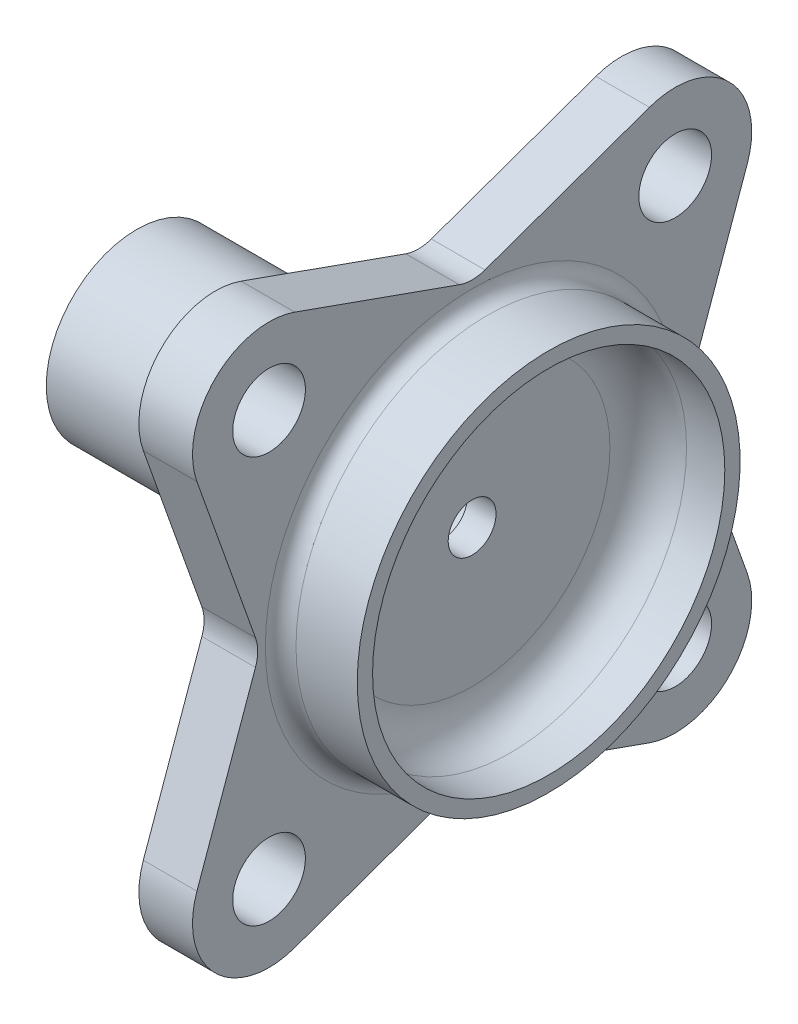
ISO-10303-21;
HEADER;
FILE_DESCRIPTION(('STEP AP214'),'2;1');
FILE_NAME('part.step','',(''),(''),'','','');
FILE_SCHEMA(('AUTOMOTIVE_DESIGN { 1 0 10303 214 1 1 1 1 }'));
ENDSEC;
DATA;
#1=APPLICATION_CONTEXT('core data for automotive mechanical design processes');
#2=APPLICATION_PROTOCOL_DEFINITION('international standard','automotive_design',2000,#1);
#3=PRODUCT_CONTEXT('',#1,'mechanical');
#4=PRODUCT('Part','Part','',(#3));
#5=PRODUCT_RELATED_PRODUCT_CATEGORY('part','',(#4));
#6=PRODUCT_DEFINITION_FORMATION('','',#4);
#7=PRODUCT_DEFINITION_CONTEXT('part definition',#1,'design');
#8=PRODUCT_DEFINITION('design','',#6,#7);
#9=PRODUCT_DEFINITION_SHAPE('','',#8);
#10=(LENGTH_UNIT() NAMED_UNIT(*) SI_UNIT(.MILLI.,.METRE.));
#11=(NAMED_UNIT(*) PLANE_ANGLE_UNIT() SI_UNIT($,.RADIAN.));
#12=(NAMED_UNIT(*) SI_UNIT($,.STERADIAN.) SOLID_ANGLE_UNIT());
#13=UNCERTAINTY_MEASURE_WITH_UNIT(LENGTH_MEASURE(1.E-05),#10,'distance_accuracy_value','');
#14=(GEOMETRIC_REPRESENTATION_CONTEXT(3) GLOBAL_UNCERTAINTY_ASSIGNED_CONTEXT((#13)) GLOBAL_UNIT_ASSIGNED_CONTEXT((#10,
#11,#12)) REPRESENTATION_CONTEXT('',''));
#15=CARTESIAN_POINT('',(0.,0.,0.));
#16=DIRECTION('',(0.,0.,1.));
#17=DIRECTION('',(1.,0.,0.));
#18=AXIS2_PLACEMENT_3D('',#15,#16,#17);
#19=CARTESIAN_POINT('',(209.598646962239,0.,0.));
#20=DIRECTION('',(1.,0.,0.));
#21=DIRECTION('',(0.,0.,-1.));
#22=AXIS2_PLACEMENT_3D('',#19,#20,#21);
#23=CYLINDRICAL_SURFACE('',#22,15.);
#24=CARTESIAN_POINT('',(39.878,0.,0.));
#25=DIRECTION('',(1.,0.,0.));
#26=DIRECTION('',(0.,1.,0.));
#27=AXIS2_PLACEMENT_3D('',#24,#25,#26);
#28=CIRCLE('',#27,15.);
#29=CARTESIAN_POINT('',(39.878,15.,0.));
#30=VERTEX_POINT('',#29);
#31=EDGE_CURVE('E203',#30,#30,#28,.T.);
#32=ORIENTED_EDGE('',*,*,#31,.F.);
#33=EDGE_LOOP('',(#32));
#34=FACE_BOUND('',#33,.T.);
#35=CARTESIAN_POINT('',(7.874,0.,0.));
#36=DIRECTION('',(-1.,0.,0.));
#37=DIRECTION('',(0.,0.,1.));
#38=AXIS2_PLACEMENT_3D('',#35,#36,#37);
#39=CIRCLE('',#38,15.);
#40=CARTESIAN_POINT('',(7.874,0.,15.));
#41=VERTEX_POINT('',#40);
#42=EDGE_CURVE('E772',#41,#41,#39,.T.);
#43=ORIENTED_EDGE('',*,*,#42,.F.);
#44=EDGE_LOOP('',(#43));
#45=FACE_BOUND('',#44,.T.);
#46=ADVANCED_FACE('F40',(#34,#45),#23,.T.);
#47=CARTESIAN_POINT('',(-5.74103503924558,0.,0.));
#48=DIRECTION('',(-1.,0.,0.));
#49=DIRECTION('',(0.,0.,1.));
#50=AXIS2_PLACEMENT_3D('',#47,#48,#49);
#51=CYLINDRICAL_SURFACE('',#50,7.9375);
#52=CARTESIAN_POINT('',(56.1975,0.,0.));
#53=DIRECTION('',(-1.,0.,0.));
#54=DIRECTION('',(0.,0.,1.));
#55=AXIS2_PLACEMENT_3D('',#52,#53,#54);
#56=CIRCLE('',#55,7.9375);
#57=CARTESIAN_POINT('',(56.1975,0.,7.9375));
#58=VERTEX_POINT('',#57);
#59=EDGE_CURVE('E264',#58,#58,#56,.T.);
#60=ORIENTED_EDGE('',*,*,#59,.F.);
#61=EDGE_LOOP('',(#60));
#62=FACE_BOUND('',#61,.T.);
#63=CARTESIAN_POINT('',(7.874,0.,0.));
#64=DIRECTION('',(-1.,0.,0.));
#65=DIRECTION('',(0.,0.,1.));
#66=AXIS2_PLACEMENT_3D('',#63,#64,#65);
#67=CIRCLE('',#66,7.9375);
#68=CARTESIAN_POINT('',(7.874,0.,7.9375));
#69=VERTEX_POINT('',#68);
#70=EDGE_CURVE('E769',#69,#69,#67,.T.);
#71=ORIENTED_EDGE('',*,*,#70,.T.);
#72=EDGE_LOOP('',(#71));
#73=FACE_BOUND('',#72,.T.);
#74=ADVANCED_FACE('F221',(#62,#73),#51,.F.);
#75=CARTESIAN_POINT('',(54.61,63.5,0.));
#76=DIRECTION('',(1.,0.,0.));
#77=DIRECTION('',(0.,0.,-1.));
#78=AXIS2_PLACEMENT_3D('',#75,#76,#77);
#79=PLANE('',#78);
#80=CARTESIAN_POINT('',(54.61,33.6759604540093,33.6759604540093));
#81=DIRECTION('',(1.,0.,0.));
#82=DIRECTION('',(0.,0.,-1.));
#83=AXIS2_PLACEMENT_3D('',#80,#81,#82);
#84=CIRCLE('',#83,7.9375);
#85=CARTESIAN_POINT('',(54.61,33.6759604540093,25.7384604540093));
#86=VERTEX_POINT('',#85);
#87=EDGE_CURVE('E49',#86,#86,#84,.F.);
#88=ORIENTED_EDGE('',*,*,#87,.F.);
#89=EDGE_LOOP('',(#88));
#90=FACE_BOUND('',#89,.T.);
#91=CARTESIAN_POINT('',(54.61,33.6759604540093,-33.6759604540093));
#92=DIRECTION('',(1.,0.,0.));
#93=DIRECTION('',(0.,0.,-1.));
#94=AXIS2_PLACEMENT_3D('',#91,#92,#93);
#95=CIRCLE('',#94,12.7);
#96=CARTESIAN_POINT('',(54.61,29.4172093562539,-45.6406183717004));
#97=VERTEX_POINT('',#96);
#98=CARTESIAN_POINT('',(54.61,45.6406183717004,-29.4172093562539));
#99=VERTEX_POINT('',#98);
#100=EDGE_CURVE('E201',#97,#99,#95,.T.);
#101=ORIENTED_EDGE('',*,*,#100,.F.);
#102=DIRECTION('',(0.,0.942099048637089,-0.335334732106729));
#103=VECTOR('',#102,1.);
#104=CARTESIAN_POINT('',(54.61,45.2486940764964,-51.2757442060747));
#105=LINE('',#104,#103);
#106=CARTESIAN_POINT('',(54.61,2.12937554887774,-35.9276710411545));
#107=VERTEX_POINT('',#106);
#108=EDGE_CURVE('E199',#107,#97,#105,.T.);
#109=ORIENTED_EDGE('',*,*,#108,.F.);
#110=CARTESIAN_POINT('',(54.61,0.,-41.91));
#111=DIRECTION('',(1.,0.,0.));
#112=DIRECTION('',(0.,0.,-1.));
#113=AXIS2_PLACEMENT_3D('',#110,#111,#112);
#114=CIRCLE('',#113,6.35);
#115=CARTESIAN_POINT('',(54.61,-2.12937554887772,-35.9276710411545));
#116=VERTEX_POINT('',#115);
#117=EDGE_CURVE('E197',#116,#107,#114,.F.);
#118=ORIENTED_EDGE('',*,*,#117,.F.);
#119=DIRECTION('',(0.,0.942099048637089,0.335334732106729));
#120=VECTOR('',#119,1.);
#121=CARTESIAN_POINT('',(54.61,67.4702343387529,-11.1540906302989));
#122=LINE('',#121,#120);
#123=CARTESIAN_POINT('',(54.61,-29.4172093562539,-45.6406183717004));
#124=VERTEX_POINT('',#123);
#125=EDGE_CURVE('E195',#124,#116,#122,.T.);
#126=ORIENTED_EDGE('',*,*,#125,.F.);
#127=CARTESIAN_POINT('',(54.61,-33.6759604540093,-33.6759604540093));
#128=DIRECTION('',(1.,0.,0.));
#129=DIRECTION('',(0.,0.,-1.));
#130=AXIS2_PLACEMENT_3D('',#127,#128,#129);
#131=CIRCLE('',#130,12.7);
#132=CARTESIAN_POINT('',(54.61,-45.6406183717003,-29.4172093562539));
#133=VERTEX_POINT('',#132);
#134=EDGE_CURVE('E193',#133,#124,#131,.T.);
#135=ORIENTED_EDGE('',*,*,#134,.F.);
#136=DIRECTION('',(0.,-0.335334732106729,-0.942099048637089));
#137=VECTOR('',#136,1.);
#138=CARTESIAN_POINT('',(54.61,-24.0743816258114,31.1715969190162));
#139=LINE('',#138,#137);
#140=CARTESIAN_POINT('',(54.61,-35.9276710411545,-2.12937554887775));
#141=VERTEX_POINT('',#140);
#142=EDGE_CURVE('E191',#141,#133,#139,.T.);
#143=ORIENTED_EDGE('',*,*,#142,.F.);
#144=CARTESIAN_POINT('',(54.61,-41.91,0.));
#145=DIRECTION('',(1.,0.,0.));
#146=DIRECTION('',(0.,0.,-1.));
#147=AXIS2_PLACEMENT_3D('',#144,#145,#146);
#148=CIRCLE('',#147,6.35000000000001);
#149=CARTESIAN_POINT('',(54.61,-35.9276710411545,2.12937554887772));
#150=VERTEX_POINT('',#149);
#151=EDGE_CURVE('E189',#150,#141,#148,.F.);
#152=ORIENTED_EDGE('',*,*,#151,.F.);
#153=DIRECTION('',(0.,0.335334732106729,-0.942099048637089));
#154=VECTOR('',#153,1.);
#155=CARTESIAN_POINT('',(54.61,-24.0743816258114,-31.1715969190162));
#156=LINE('',#155,#154);
#157=CARTESIAN_POINT('',(54.61,-45.6406183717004,29.4172093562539));
#158=VERTEX_POINT('',#157);
#159=EDGE_CURVE('E187',#158,#150,#156,.T.);
#160=ORIENTED_EDGE('',*,*,#159,.F.);
#161=CARTESIAN_POINT('',(54.61,-33.6759604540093,33.6759604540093));
#162=DIRECTION('',(1.,0.,0.));
#163=DIRECTION('',(0.,0.,-1.));
#164=AXIS2_PLACEMENT_3D('',#161,#162,#163);
#165=CIRCLE('',#164,12.7);
#166=CARTESIAN_POINT('',(54.61,-29.4172093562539,45.6406183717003));
#167=VERTEX_POINT('',#166);
#168=EDGE_CURVE('E185',#167,#158,#165,.T.);
#169=ORIENTED_EDGE('',*,*,#168,.F.);
#170=DIRECTION('',(0.,-0.942099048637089,0.335334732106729));
#171=VECTOR('',#170,1.);
#172=CARTESIAN_POINT('',(54.61,67.4702343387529,11.1540906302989));
#173=LINE('',#172,#171);
#174=CARTESIAN_POINT('',(54.61,-2.12937554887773,35.9276710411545));
#175=VERTEX_POINT('',#174);
#176=EDGE_CURVE('E183',#175,#167,#173,.T.);
#177=ORIENTED_EDGE('',*,*,#176,.F.);
#178=CARTESIAN_POINT('',(54.61,0.,41.91));
#179=DIRECTION('',(1.,0.,0.));
#180=DIRECTION('',(0.,0.,-1.));
#181=AXIS2_PLACEMENT_3D('',#178,#179,#180);
#182=CIRCLE('',#181,6.35);
#183=CARTESIAN_POINT('',(54.61,2.12937554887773,35.9276710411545));
#184=VERTEX_POINT('',#183);
#185=EDGE_CURVE('E181',#184,#175,#182,.F.);
#186=ORIENTED_EDGE('',*,*,#185,.F.);
#187=DIRECTION('',(0.,-0.942099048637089,-0.335334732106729));
#188=VECTOR('',#187,1.);
#189=CARTESIAN_POINT('',(54.61,45.2486940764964,51.2757442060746));
#190=LINE('',#189,#188);
#191=CARTESIAN_POINT('',(54.61,29.4172093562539,45.6406183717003));
#192=VERTEX_POINT('',#191);
#193=EDGE_CURVE('E179',#192,#184,#190,.T.);
#194=ORIENTED_EDGE('',*,*,#193,.F.);
#195=CARTESIAN_POINT('',(54.61,33.6759604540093,33.6759604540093));
#196=DIRECTION('',(1.,0.,0.));
#197=DIRECTION('',(0.,0.,-1.));
#198=AXIS2_PLACEMENT_3D('',#195,#196,#197);
#199=CIRCLE('',#198,12.7);
#200=CARTESIAN_POINT('',(54.61,45.6406183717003,29.4172093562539));
#201=VERTEX_POINT('',#200);
#202=EDGE_CURVE('E174',#201,#192,#199,.T.);
#203=ORIENTED_EDGE('',*,*,#202,.F.);
#204=DIRECTION('',(0.,0.335334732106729,0.942099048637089));
#205=VECTOR('',#204,1.);
#206=CARTESIAN_POINT('',(54.61,38.3554532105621,8.95005665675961));
#207=LINE('',#206,#205);
#208=CARTESIAN_POINT('',(54.61,35.9276710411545,2.12937554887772));
#209=VERTEX_POINT('',#208);
#210=EDGE_CURVE('E172',#209,#201,#207,.T.);
#211=ORIENTED_EDGE('',*,*,#210,.F.);
#212=CARTESIAN_POINT('',(54.61,41.91,0.));
#213=DIRECTION('',(1.,0.,0.));
#214=DIRECTION('',(0.,0.,-1.));
#215=AXIS2_PLACEMENT_3D('',#212,#213,#214);
#216=CIRCLE('',#215,6.35);
#217=CARTESIAN_POINT('',(54.61,35.9276710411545,-2.12937554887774));
#218=VERTEX_POINT('',#217);
#219=EDGE_CURVE('E156',#218,#209,#216,.F.);
#220=ORIENTED_EDGE('',*,*,#219,.F.);
#221=DIRECTION('',(0.,-0.335334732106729,0.942099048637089));
#222=VECTOR('',#221,1.);
#223=CARTESIAN_POINT('',(54.61,38.3554532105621,-8.95005665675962));
#224=LINE('',#223,#222);
#225=EDGE_CURVE('E151',#99,#218,#224,.T.);
#226=ORIENTED_EDGE('',*,*,#225,.F.);
#227=EDGE_LOOP('',(#101,#109,#118,#126,#135,#143,#152,#160,#169,#177,#186,#194,#203,#211,#220,#226));
#228=FACE_BOUND('',#227,.T.);
#229=CARTESIAN_POINT('',(54.61,-33.6759604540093,-33.6759604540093));
#230=DIRECTION('',(1.,0.,0.));
#231=DIRECTION('',(0.,0.,-1.));
#232=AXIS2_PLACEMENT_3D('',#229,#230,#231);
#233=CIRCLE('',#232,6.03249999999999);
#234=CARTESIAN_POINT('',(54.61,-33.6759604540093,-39.7084604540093));
#235=VERTEX_POINT('',#234);
#236=EDGE_CURVE('E380',#235,#235,#233,.T.);
#237=ORIENTED_EDGE('',*,*,#236,.T.);
#238=EDGE_LOOP('',(#237));
#239=FACE_BOUND('',#238,.T.);
#240=CARTESIAN_POINT('',(54.61,-33.6759604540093,33.6759604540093));
#241=DIRECTION('',(1.,0.,0.));
#242=DIRECTION('',(0.,0.,-1.));
#243=AXIS2_PLACEMENT_3D('',#240,#241,#242);
#244=CIRCLE('',#243,6.03249999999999);
#245=CARTESIAN_POINT('',(54.61,-33.6759604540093,27.6434604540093));
#246=VERTEX_POINT('',#245);
#247=EDGE_CURVE('E298',#246,#246,#244,.T.);
#248=ORIENTED_EDGE('',*,*,#247,.T.);
#249=EDGE_LOOP('',(#248));
#250=FACE_BOUND('',#249,.T.);
#251=CARTESIAN_POINT('',(54.61,0.,0.));
#252=DIRECTION('',(1.,0.,0.));
#253=DIRECTION('',(0.,0.,-1.));
#254=AXIS2_PLACEMENT_3D('',#251,#252,#253);
#255=CIRCLE('',#254,28.575);
#256=CARTESIAN_POINT('',(54.61,0.,-28.575));
#257=VERTEX_POINT('',#256);
#258=EDGE_CURVE('E207',#257,#257,#255,.F.);
#259=ORIENTED_EDGE('',*,*,#258,.F.);
#260=EDGE_LOOP('',(#259));
#261=FACE_BOUND('',#260,.T.);
#262=CARTESIAN_POINT('',(54.61,33.6759604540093,-33.6759604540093));
#263=DIRECTION('',(1.,0.,0.));
#264=DIRECTION('',(0.,0.,-1.));
#265=AXIS2_PLACEMENT_3D('',#262,#263,#264);
#266=CIRCLE('',#265,7.9375);
#267=CARTESIAN_POINT('',(54.61,33.6759604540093,-41.6134604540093));
#268=VERTEX_POINT('',#267);
#269=EDGE_CURVE('E12',#268,#268,#266,.F.);
#270=ORIENTED_EDGE('',*,*,#269,.F.);
#271=EDGE_LOOP('',(#270));
#272=FACE_BOUND('',#271,.T.);
#273=ADVANCED_FACE('F169',(#90,#228,#239,#250,#261,#272),#79,.F.);
#274=ORIENTED_EDGE('',*,*,#269,.T.);
#275=EDGE_LOOP('',(#274));
#276=FACE_BOUND('',#275,.T.);
#277=CARTESIAN_POINT('',(54.61,33.6759604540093,-33.6759604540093));
#278=DIRECTION('',(1.,0.,0.));
#279=DIRECTION('',(0.,0.,-1.));
#280=AXIS2_PLACEMENT_3D('',#277,#278,#279);
#281=CIRCLE('',#280,6.03249999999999);
#282=CARTESIAN_POINT('',(54.61,33.6759604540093,-39.7084604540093));
#283=VERTEX_POINT('',#282);
#284=EDGE_CURVE('E376',#283,#283,#281,.T.);
#285=ORIENTED_EDGE('',*,*,#284,.T.);
#286=EDGE_LOOP('',(#285));
#287=FACE_BOUND('',#286,.T.);
#288=ADVANCED_FACE('F220',(#276,#287),#79,.F.);
#289=ORIENTED_EDGE('',*,*,#87,.T.);
#290=EDGE_LOOP('',(#289));
#291=FACE_BOUND('',#290,.T.);
#292=CARTESIAN_POINT('',(54.61,33.6759604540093,33.6759604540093));
#293=DIRECTION('',(1.,0.,0.));
#294=DIRECTION('',(0.,0.,-1.));
#295=AXIS2_PLACEMENT_3D('',#292,#293,#294);
#296=CIRCLE('',#295,6.03249999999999);
#297=CARTESIAN_POINT('',(54.61,33.6759604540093,27.6434604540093));
#298=VERTEX_POINT('',#297);
#299=EDGE_CURVE('E289',#298,#298,#296,.T.);
#300=ORIENTED_EDGE('',*,*,#299,.T.);
#301=EDGE_LOOP('',(#300));
#302=FACE_BOUND('',#301,.T.);
#303=ADVANCED_FACE('F216',(#291,#302),#79,.F.);
#304=CARTESIAN_POINT('',(63.5,63.5,0.));
#305=DIRECTION('',(1.,0.,0.));
#306=DIRECTION('',(0.,0.,-1.));
#307=AXIS2_PLACEMENT_3D('',#304,#305,#306);
#308=PLANE('',#307);
#309=CARTESIAN_POINT('',(63.5,0.,0.));
#310=DIRECTION('',(-1.,0.,0.));
#311=DIRECTION('',(0.,0.,1.));
#312=AXIS2_PLACEMENT_3D('',#309,#310,#311);
#313=CIRCLE('',#312,34.29);
#314=CARTESIAN_POINT('',(63.5,0.,34.29));
#315=VERTEX_POINT('',#314);
#316=EDGE_CURVE('E282',#315,#315,#313,.T.);
#317=ORIENTED_EDGE('',*,*,#316,.T.);
#318=EDGE_LOOP('',(#317));
#319=FACE_BOUND('',#318,.T.);
#320=CARTESIAN_POINT('',(63.5,33.6759604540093,33.6759604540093));
#321=DIRECTION('',(1.,0.,0.));
#322=DIRECTION('',(0.,0.,-1.));
#323=AXIS2_PLACEMENT_3D('',#320,#321,#322);
#324=CIRCLE('',#323,6.0325);
#325=CARTESIAN_POINT('',(63.5,33.6759604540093,27.6434604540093));
#326=VERTEX_POINT('',#325);
#327=EDGE_CURVE('E292',#326,#326,#324,.T.);
#328=ORIENTED_EDGE('',*,*,#327,.F.);
#329=EDGE_LOOP('',(#328));
#330=FACE_BOUND('',#329,.T.);
#331=CARTESIAN_POINT('',(63.5,-33.6759604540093,33.6759604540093));
#332=DIRECTION('',(1.,0.,0.));
#333=DIRECTION('',(0.,0.,-1.));
#334=AXIS2_PLACEMENT_3D('',#331,#332,#333);
#335=CIRCLE('',#334,6.03249999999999);
#336=CARTESIAN_POINT('',(63.5,-33.6759604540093,27.6434604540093));
#337=VERTEX_POINT('',#336);
#338=EDGE_CURVE('E303',#337,#337,#335,.T.);
#339=ORIENTED_EDGE('',*,*,#338,.F.);
#340=EDGE_LOOP('',(#339));
#341=FACE_BOUND('',#340,.T.);
#342=CARTESIAN_POINT('',(63.5,-33.6759604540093,-33.6759604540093));
#343=DIRECTION('',(1.,0.,0.));
#344=DIRECTION('',(0.,0.,-1.));
#345=AXIS2_PLACEMENT_3D('',#342,#343,#344);
#346=CIRCLE('',#345,6.03249999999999);
#347=CARTESIAN_POINT('',(63.5,-33.6759604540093,-39.7084604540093));
#348=VERTEX_POINT('',#347);
#349=EDGE_CURVE('E353',#348,#348,#346,.T.);
#350=ORIENTED_EDGE('',*,*,#349,.F.);
#351=EDGE_LOOP('',(#350));
#352=FACE_BOUND('',#351,.T.);
#353=CARTESIAN_POINT('',(63.5,33.6759604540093,-33.6759604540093));
#354=DIRECTION('',(1.,0.,0.));
#355=DIRECTION('',(0.,0.,-1.));
#356=AXIS2_PLACEMENT_3D('',#353,#354,#355);
#357=CIRCLE('',#356,6.0325);
#358=CARTESIAN_POINT('',(63.5,33.6759604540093,-39.7084604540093));
#359=VERTEX_POINT('',#358);
#360=EDGE_CURVE('E357',#359,#359,#357,.T.);
#361=ORIENTED_EDGE('',*,*,#360,.F.);
#362=EDGE_LOOP('',(#361));
#363=FACE_BOUND('',#362,.T.);
#364=DIRECTION('',(0.,0.942099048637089,-0.335334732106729));
#365=VECTOR('',#364,1.);
#366=CARTESIAN_POINT('',(63.5,45.2486940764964,-51.2757442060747));
#367=LINE('',#366,#365);
#368=CARTESIAN_POINT('',(63.5,2.12937554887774,-35.9276710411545));
#369=VERTEX_POINT('',#368);
#370=CARTESIAN_POINT('',(63.5,29.4172093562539,-45.6406183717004));
#371=VERTEX_POINT('',#370);
#372=EDGE_CURVE('E361',#369,#371,#367,.T.);
#373=ORIENTED_EDGE('',*,*,#372,.T.);
#374=CARTESIAN_POINT('',(63.5,33.6759604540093,-33.6759604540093));
#375=DIRECTION('',(1.,0.,0.));
#376=DIRECTION('',(0.,0.,-1.));
#377=AXIS2_PLACEMENT_3D('',#374,#375,#376);
#378=CIRCLE('',#377,12.7);
#379=CARTESIAN_POINT('',(63.5,45.6406183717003,-29.4172093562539));
#380=VERTEX_POINT('',#379);
#381=EDGE_CURVE('E362',#371,#380,#378,.T.);
#382=ORIENTED_EDGE('',*,*,#381,.T.);
#383=DIRECTION('',(0.,-0.335334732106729,0.942099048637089));
#384=VECTOR('',#383,1.);
#385=CARTESIAN_POINT('',(63.5,38.3554532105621,-8.95005665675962));
#386=LINE('',#385,#384);
#387=CARTESIAN_POINT('',(63.5,35.9276710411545,-2.12937554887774));
#388=VERTEX_POINT('',#387);
#389=EDGE_CURVE('E779',#380,#388,#386,.T.);
#390=ORIENTED_EDGE('',*,*,#389,.T.);
#391=CARTESIAN_POINT('',(63.5,41.91,0.));
#392=DIRECTION('',(1.,0.,0.));
#393=DIRECTION('',(0.,0.,-1.));
#394=AXIS2_PLACEMENT_3D('',#391,#392,#393);
#395=CIRCLE('',#394,6.35);
#396=CARTESIAN_POINT('',(63.5,35.9276710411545,2.12937554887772));
#397=VERTEX_POINT('',#396);
#398=EDGE_CURVE('E164',#388,#397,#395,.F.);
#399=ORIENTED_EDGE('',*,*,#398,.T.);
#400=DIRECTION('',(0.,0.335334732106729,0.942099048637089));
#401=VECTOR('',#400,1.);
#402=CARTESIAN_POINT('',(63.5,38.3554532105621,8.95005665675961));
#403=LINE('',#402,#401);
#404=CARTESIAN_POINT('',(63.5,45.6406183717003,29.4172093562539));
#405=VERTEX_POINT('',#404);
#406=EDGE_CURVE('E818',#397,#405,#403,.T.);
#407=ORIENTED_EDGE('',*,*,#406,.T.);
#408=CARTESIAN_POINT('',(63.5,33.6759604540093,33.6759604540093));
#409=DIRECTION('',(1.,0.,0.));
#410=DIRECTION('',(0.,0.,-1.));
#411=AXIS2_PLACEMENT_3D('',#408,#409,#410);
#412=CIRCLE('',#411,12.7);
#413=CARTESIAN_POINT('',(63.5,29.4172093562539,45.6406183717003));
#414=VERTEX_POINT('',#413);
#415=EDGE_CURVE('E821',#405,#414,#412,.T.);
#416=ORIENTED_EDGE('',*,*,#415,.T.);
#417=DIRECTION('',(0.,-0.942099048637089,-0.335334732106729));
#418=VECTOR('',#417,1.);
#419=CARTESIAN_POINT('',(63.5,45.2486940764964,51.2757442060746));
#420=LINE('',#419,#418);
#421=CARTESIAN_POINT('',(63.5,2.12937554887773,35.9276710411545));
#422=VERTEX_POINT('',#421);
#423=EDGE_CURVE('E824',#414,#422,#420,.T.);
#424=ORIENTED_EDGE('',*,*,#423,.T.);
#425=CARTESIAN_POINT('',(63.5,0.,41.91));
#426=DIRECTION('',(1.,0.,0.));
#427=DIRECTION('',(0.,0.,-1.));
#428=AXIS2_PLACEMENT_3D('',#425,#426,#427);
#429=CIRCLE('',#428,6.35);
#430=CARTESIAN_POINT('',(63.5,-2.12937554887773,35.9276710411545));
#431=VERTEX_POINT('',#430);
#432=EDGE_CURVE('E827',#422,#431,#429,.F.);
#433=ORIENTED_EDGE('',*,*,#432,.T.);
#434=DIRECTION('',(0.,-0.942099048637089,0.335334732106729));
#435=VECTOR('',#434,1.);
#436=CARTESIAN_POINT('',(63.5,67.4702343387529,11.1540906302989));
#437=LINE('',#436,#435);
#438=CARTESIAN_POINT('',(63.5,-29.4172093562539,45.6406183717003));
#439=VERTEX_POINT('',#438);
#440=EDGE_CURVE('E830',#431,#439,#437,.T.);
#441=ORIENTED_EDGE('',*,*,#440,.T.);
#442=CARTESIAN_POINT('',(63.5,-33.6759604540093,33.6759604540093));
#443=DIRECTION('',(1.,0.,0.));
#444=DIRECTION('',(0.,0.,-1.));
#445=AXIS2_PLACEMENT_3D('',#442,#443,#444);
#446=CIRCLE('',#445,12.7);
#447=CARTESIAN_POINT('',(63.5,-45.6406183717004,29.4172093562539));
#448=VERTEX_POINT('',#447);
#449=EDGE_CURVE('E833',#439,#448,#446,.T.);
#450=ORIENTED_EDGE('',*,*,#449,.T.);
#451=DIRECTION('',(0.,0.335334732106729,-0.942099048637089));
#452=VECTOR('',#451,1.);
#453=CARTESIAN_POINT('',(63.5,-24.0743816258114,-31.1715969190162));
#454=LINE('',#453,#452);
#455=CARTESIAN_POINT('',(63.5,-35.9276710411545,2.12937554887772));
#456=VERTEX_POINT('',#455);
#457=EDGE_CURVE('E836',#448,#456,#454,.T.);
#458=ORIENTED_EDGE('',*,*,#457,.T.);
#459=CARTESIAN_POINT('',(63.5,-41.91,0.));
#460=DIRECTION('',(1.,0.,0.));
#461=DIRECTION('',(0.,0.,-1.));
#462=AXIS2_PLACEMENT_3D('',#459,#460,#461);
#463=CIRCLE('',#462,6.35000000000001);
#464=CARTESIAN_POINT('',(63.5,-35.9276710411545,-2.12937554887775));
#465=VERTEX_POINT('',#464);
#466=EDGE_CURVE('E839',#456,#465,#463,.F.);
#467=ORIENTED_EDGE('',*,*,#466,.T.);
#468=DIRECTION('',(0.,-0.335334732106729,-0.942099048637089));
#469=VECTOR('',#468,1.);
#470=CARTESIAN_POINT('',(63.5,-24.0743816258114,31.1715969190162));
#471=LINE('',#470,#469);
#472=CARTESIAN_POINT('',(63.5,-45.6406183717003,-29.4172093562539));
#473=VERTEX_POINT('',#472);
#474=EDGE_CURVE('E842',#465,#473,#471,.T.);
#475=ORIENTED_EDGE('',*,*,#474,.T.);
#476=CARTESIAN_POINT('',(63.5,-33.6759604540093,-33.6759604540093));
#477=DIRECTION('',(1.,0.,0.));
#478=DIRECTION('',(0.,0.,-1.));
#479=AXIS2_PLACEMENT_3D('',#476,#477,#478);
#480=CIRCLE('',#479,12.7);
#481=CARTESIAN_POINT('',(63.5,-29.4172093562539,-45.6406183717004));
#482=VERTEX_POINT('',#481);
#483=EDGE_CURVE('E845',#473,#482,#480,.T.);
#484=ORIENTED_EDGE('',*,*,#483,.T.);
#485=DIRECTION('',(0.,0.942099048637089,0.335334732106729));
#486=VECTOR('',#485,1.);
#487=CARTESIAN_POINT('',(63.5,67.4702343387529,-11.1540906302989));
#488=LINE('',#487,#486);
#489=CARTESIAN_POINT('',(63.5,-2.12937554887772,-35.9276710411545));
#490=VERTEX_POINT('',#489);
#491=EDGE_CURVE('E371',#482,#490,#488,.T.);
#492=ORIENTED_EDGE('',*,*,#491,.T.);
#493=CARTESIAN_POINT('',(63.5,0.,-41.91));
#494=DIRECTION('',(1.,0.,0.));
#495=DIRECTION('',(0.,0.,-1.));
#496=AXIS2_PLACEMENT_3D('',#493,#494,#495);
#497=CIRCLE('',#496,6.35);
#498=EDGE_CURVE('E364',#490,#369,#497,.F.);
#499=ORIENTED_EDGE('',*,*,#498,.T.);
#500=EDGE_LOOP('',(#373,#382,#390,#399,#407,#416,#424,#433,#441,#450,#458,#467,#475,#484,#492,#499));
#501=FACE_BOUND('',#500,.T.);
#502=ADVANCED_FACE('F235',(#319,#330,#341,#352,#363,#501),#308,.T.);
#503=ORIENTED_EDGE('',*,*,#258,.T.);
#504=EDGE_LOOP('',(#503));
#505=FACE_BOUND('',#504,.T.);
#506=CARTESIAN_POINT('',(54.61,0.,0.));
#507=DIRECTION('',(1.,0.,0.));
#508=DIRECTION('',(0.,0.,-1.));
#509=AXIS2_PLACEMENT_3D('',#506,#507,#508);
#510=CIRCLE('',#509,23.382);
#511=CARTESIAN_POINT('',(54.61,0.,-23.382));
#512=VERTEX_POINT('',#511);
#513=EDGE_CURVE('E263',#512,#512,#510,.T.);
#514=ORIENTED_EDGE('',*,*,#513,.T.);
#515=EDGE_LOOP('',(#514));
#516=FACE_BOUND('',#515,.T.);
#517=ADVANCED_FACE('F223',(#505,#516),#79,.F.);
#518=CARTESIAN_POINT('',(63.5,22.86,0.));
#519=DIRECTION('',(-1.,0.,0.));
#520=DIRECTION('',(0.,0.,1.));
#521=AXIS2_PLACEMENT_3D('',#518,#519,#520);
#522=PLANE('',#521);
#523=CARTESIAN_POINT('',(63.5,0.,0.));
#524=DIRECTION('',(1.,0.,0.));
#525=DIRECTION('',(0.,0.,-1.));
#526=AXIS2_PLACEMENT_3D('',#523,#524,#525);
#527=CIRCLE('',#526,22.86);
#528=CARTESIAN_POINT('',(63.5,0.,-22.86));
#529=VERTEX_POINT('',#528);
#530=EDGE_CURVE('E279',#529,#529,#527,.T.);
#531=ORIENTED_EDGE('',*,*,#530,.T.);
#532=EDGE_LOOP('',(#531));
#533=FACE_BOUND('',#532,.T.);
#534=CARTESIAN_POINT('',(63.5,0.,0.));
#535=DIRECTION('',(-1.,0.,0.));
#536=DIRECTION('',(0.,0.,1.));
#537=AXIS2_PLACEMENT_3D('',#534,#535,#536);
#538=CIRCLE('',#537,3.96875);
#539=CARTESIAN_POINT('',(63.5,0.,3.96875));
#540=VERTEX_POINT('',#539);
#541=EDGE_CURVE('E291',#540,#540,#538,.T.);
#542=ORIENTED_EDGE('',*,*,#541,.T.);
#543=EDGE_LOOP('',(#542));
#544=FACE_BOUND('',#543,.T.);
#545=ADVANCED_FACE('F234',(#533,#544),#522,.F.);
#546=CARTESIAN_POINT('',(-46.516862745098,0.,0.));
#547=DIRECTION('',(-1.,0.,0.));
#548=DIRECTION('',(0.,0.,1.));
#549=AXIS2_PLACEMENT_3D('',#546,#547,#548);
#550=CYLINDRICAL_SURFACE('',#549,31.75);
#551=CARTESIAN_POINT('',(76.2,0.,0.));
#552=DIRECTION('',(-1.,0.,0.));
#553=DIRECTION('',(0.,0.,1.));
#554=AXIS2_PLACEMENT_3D('',#551,#552,#553);
#555=CIRCLE('',#554,31.75);
#556=CARTESIAN_POINT('',(76.2,0.,31.75));
#557=VERTEX_POINT('',#556);
#558=EDGE_CURVE('E157',#557,#557,#555,.T.);
#559=ORIENTED_EDGE('',*,*,#558,.T.);
#560=EDGE_LOOP('',(#559));
#561=FACE_BOUND('',#560,.T.);
#562=CARTESIAN_POINT('',(66.04,0.,0.));
#563=DIRECTION('',(-1.,0.,0.));
#564=DIRECTION('',(0.,0.,1.));
#565=AXIS2_PLACEMENT_3D('',#562,#563,#564);
#566=CIRCLE('',#565,31.75);
#567=CARTESIAN_POINT('',(66.04,0.,31.75));
#568=VERTEX_POINT('',#567);
#569=EDGE_CURVE('E285',#568,#568,#566,.T.);
#570=ORIENTED_EDGE('',*,*,#569,.F.);
#571=EDGE_LOOP('',(#570));
#572=FACE_BOUND('',#571,.T.);
#573=ADVANCED_FACE('F325',(#561,#572),#550,.T.);
#574=CARTESIAN_POINT('',(66.04,0.,0.));
#575=DIRECTION('',(-1.,0.,0.));
#576=DIRECTION('',(0.,0.,1.));
#577=AXIS2_PLACEMENT_3D('',#574,#575,#576);
#578=TOROIDAL_SURFACE('',#577,34.29,2.54);
#579=ORIENTED_EDGE('',*,*,#569,.T.);
#580=EDGE_LOOP('',(#579));
#581=FACE_BOUND('',#580,.T.);
#582=ORIENTED_EDGE('',*,*,#316,.F.);
#583=EDGE_LOOP('',(#582));
#584=FACE_BOUND('',#583,.T.);
#585=ADVANCED_FACE('F331',(#581,#584),#578,.F.);
#586=CARTESIAN_POINT('',(76.2,0.,0.));
#587=DIRECTION('',(-1.,0.,0.));
#588=DIRECTION('',(0.,0.,1.));
#589=AXIS2_PLACEMENT_3D('',#586,#587,#588);
#590=PLANE('',#589);
#591=CARTESIAN_POINT('',(76.2,0.,0.));
#592=DIRECTION('',(1.,0.,0.));
#593=DIRECTION('',(0.,0.,-1.));
#594=AXIS2_PLACEMENT_3D('',#591,#592,#593);
#595=CIRCLE('',#594,29.21);
#596=CARTESIAN_POINT('',(76.2,0.,-29.21));
#597=VERTEX_POINT('',#596);
#598=EDGE_CURVE('E267',#597,#597,#595,.T.);
#599=ORIENTED_EDGE('',*,*,#598,.F.);
#600=EDGE_LOOP('',(#599));
#601=FACE_BOUND('',#600,.T.);
#602=ORIENTED_EDGE('',*,*,#558,.F.);
#603=EDGE_LOOP('',(#602));
#604=FACE_BOUND('',#603,.T.);
#605=ADVANCED_FACE('F42',(#601,#604),#590,.F.);
#606=CARTESIAN_POINT('',(69.85,0.,0.));
#607=DIRECTION('',(1.,0.,0.));
#608=DIRECTION('',(0.,0.,-1.));
#609=AXIS2_PLACEMENT_3D('',#606,#607,#608);
#610=TOROIDAL_SURFACE('',#609,22.86,6.35);
#611=ORIENTED_EDGE('',*,*,#530,.F.);
#612=EDGE_LOOP('',(#611));
#613=FACE_BOUND('',#612,.T.);
#614=CARTESIAN_POINT('',(69.85,0.,0.));
#615=DIRECTION('',(1.,0.,0.));
#616=DIRECTION('',(0.,0.,-1.));
#617=AXIS2_PLACEMENT_3D('',#614,#615,#616);
#618=CIRCLE('',#617,29.21);
#619=CARTESIAN_POINT('',(69.85,0.,-29.21));
#620=VERTEX_POINT('',#619);
#621=EDGE_CURVE('E276',#620,#620,#618,.T.);
#622=ORIENTED_EDGE('',*,*,#621,.T.);
#623=EDGE_LOOP('',(#622));
#624=FACE_BOUND('',#623,.T.);
#625=ADVANCED_FACE('F336',(#613,#624),#610,.F.);
#626=CARTESIAN_POINT('',(216.384356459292,0.,0.));
#627=DIRECTION('',(1.,0.,0.));
#628=DIRECTION('',(0.,0.,-1.));
#629=AXIS2_PLACEMENT_3D('',#626,#627,#628);
#630=CYLINDRICAL_SURFACE('',#629,29.21);
#631=ORIENTED_EDGE('',*,*,#621,.F.);
#632=EDGE_LOOP('',(#631));
#633=FACE_BOUND('',#632,.T.);
#634=ORIENTED_EDGE('',*,*,#598,.T.);
#635=EDGE_LOOP('',(#634));
#636=FACE_BOUND('',#635,.T.);
#637=ADVANCED_FACE('F256',(#633,#636),#630,.F.);
#638=CARTESIAN_POINT('',(46.228,0.,0.));
#639=DIRECTION('',(1.,0.,0.));
#640=DIRECTION('',(0.,0.,-1.));
#641=AXIS2_PLACEMENT_3D('',#638,#639,#640);
#642=TOROIDAL_SURFACE('',#641,23.382,8.382);
#643=ORIENTED_EDGE('',*,*,#513,.F.);
#644=EDGE_LOOP('',(#643));
#645=FACE_BOUND('',#644,.T.);
#646=CARTESIAN_POINT('',(46.228,0.,0.));
#647=DIRECTION('',(1.,0.,0.));
#648=DIRECTION('',(0.,0.,-1.));
#649=AXIS2_PLACEMENT_3D('',#646,#647,#648);
#650=CIRCLE('',#649,15.);
#651=CARTESIAN_POINT('',(46.228,0.,-15.));
#652=VERTEX_POINT('',#651);
#653=EDGE_CURVE('E261',#652,#652,#650,.T.);
#654=ORIENTED_EDGE('',*,*,#653,.T.);
#655=EDGE_LOOP('',(#654));
#656=FACE_BOUND('',#655,.T.);
#657=ADVANCED_FACE('F247',(#645,#656),#642,.F.);
#658=ORIENTED_EDGE('',*,*,#31,.T.);
#659=EDGE_LOOP('',(#658));
#660=FACE_BOUND('',#659,.T.);
#661=ORIENTED_EDGE('',*,*,#653,.F.);
#662=EDGE_LOOP('',(#661));
#663=FACE_BOUND('',#662,.T.);
#664=ADVANCED_FACE('F240',(#660,#663),#23,.T.);
#665=CARTESIAN_POINT('',(56.1975,0.,0.));
#666=DIRECTION('',(-1.,0.,0.));
#667=DIRECTION('',(0.,0.,1.));
#668=AXIS2_PLACEMENT_3D('',#665,#666,#667);
#669=TOROIDAL_SURFACE('',#668,5.3975,2.54);
#670=ORIENTED_EDGE('',*,*,#59,.T.);
#671=EDGE_LOOP('',(#670));
#672=FACE_BOUND('',#671,.T.);
#673=CARTESIAN_POINT('',(58.7375,0.,0.));
#674=DIRECTION('',(-1.,0.,0.));
#675=DIRECTION('',(0.,0.,1.));
#676=AXIS2_PLACEMENT_3D('',#673,#674,#675);
#677=CIRCLE('',#676,5.3975);
#678=CARTESIAN_POINT('',(58.7375,0.,5.3975));
#679=VERTEX_POINT('',#678);
#680=EDGE_CURVE('E270',#679,#679,#677,.T.);
#681=ORIENTED_EDGE('',*,*,#680,.F.);
#682=EDGE_LOOP('',(#681));
#683=FACE_BOUND('',#682,.T.);
#684=ADVANCED_FACE('F246',(#672,#683),#669,.F.);
#685=CARTESIAN_POINT('',(58.7375,5.3975,0.));
#686=DIRECTION('',(-1.,0.,0.));
#687=DIRECTION('',(0.,0.,1.));
#688=AXIS2_PLACEMENT_3D('',#685,#686,#687);
#689=PLANE('',#688);
#690=ORIENTED_EDGE('',*,*,#680,.T.);
#691=EDGE_LOOP('',(#690));
#692=FACE_BOUND('',#691,.T.);
#693=CARTESIAN_POINT('',(58.7375,0.,0.));
#694=DIRECTION('',(-1.,0.,0.));
#695=DIRECTION('',(0.,0.,1.));
#696=AXIS2_PLACEMENT_3D('',#693,#694,#695);
#697=CIRCLE('',#696,3.96875);
#698=CARTESIAN_POINT('',(58.7375,0.,3.96875));
#699=VERTEX_POINT('',#698);
#700=EDGE_CURVE('E295',#699,#699,#697,.T.);
#701=ORIENTED_EDGE('',*,*,#700,.F.);
#702=EDGE_LOOP('',(#701));
#703=FACE_BOUND('',#702,.T.);
#704=ADVANCED_FACE('F253',(#692,#703),#689,.T.);
#705=CARTESIAN_POINT('',(-5.74103503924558,0.,0.));
#706=DIRECTION('',(-1.,0.,0.));
#707=DIRECTION('',(0.,0.,1.));
#708=AXIS2_PLACEMENT_3D('',#705,#706,#707);
#709=CYLINDRICAL_SURFACE('',#708,3.96875);
#710=ORIENTED_EDGE('',*,*,#700,.T.);
#711=EDGE_LOOP('',(#710));
#712=FACE_BOUND('',#711,.T.);
#713=ORIENTED_EDGE('',*,*,#541,.F.);
#714=EDGE_LOOP('',(#713));
#715=FACE_BOUND('',#714,.T.);
#716=ADVANCED_FACE('F314',(#712,#715),#709,.F.);
#717=CARTESIAN_POINT('',(63.5,33.6759604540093,33.6759604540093));
#718=DIRECTION('',(1.,0.,0.));
#719=DIRECTION('',(0.,0.,-1.));
#720=AXIS2_PLACEMENT_3D('',#717,#718,#719);
#721=CYLINDRICAL_SURFACE('',#720,6.03249999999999);
#722=ORIENTED_EDGE('',*,*,#327,.T.);
#723=EDGE_LOOP('',(#722));
#724=FACE_BOUND('',#723,.T.);
#725=ORIENTED_EDGE('',*,*,#299,.F.);
#726=EDGE_LOOP('',(#725));
#727=FACE_BOUND('',#726,.T.);
#728=ADVANCED_FACE('F320',(#724,#727),#721,.F.);
#729=CARTESIAN_POINT('',(63.5,-33.6759604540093,33.6759604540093));
#730=DIRECTION('',(1.,0.,0.));
#731=DIRECTION('',(0.,0.,-1.));
#732=AXIS2_PLACEMENT_3D('',#729,#730,#731);
#733=CYLINDRICAL_SURFACE('',#732,6.03249999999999);
#734=ORIENTED_EDGE('',*,*,#338,.T.);
#735=EDGE_LOOP('',(#734));
#736=FACE_BOUND('',#735,.T.);
#737=ORIENTED_EDGE('',*,*,#247,.F.);
#738=EDGE_LOOP('',(#737));
#739=FACE_BOUND('',#738,.T.);
#740=ADVANCED_FACE('F383',(#736,#739),#733,.F.);
#741=CARTESIAN_POINT('',(63.5,-33.6759604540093,-33.6759604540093));
#742=DIRECTION('',(1.,0.,0.));
#743=DIRECTION('',(0.,0.,-1.));
#744=AXIS2_PLACEMENT_3D('',#741,#742,#743);
#745=CYLINDRICAL_SURFACE('',#744,6.03249999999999);
#746=ORIENTED_EDGE('',*,*,#349,.T.);
#747=EDGE_LOOP('',(#746));
#748=FACE_BOUND('',#747,.T.);
#749=ORIENTED_EDGE('',*,*,#236,.F.);
#750=EDGE_LOOP('',(#749));
#751=FACE_BOUND('',#750,.T.);
#752=ADVANCED_FACE('F386',(#748,#751),#745,.F.);
#753=CARTESIAN_POINT('',(63.5,33.6759604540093,-33.6759604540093));
#754=DIRECTION('',(1.,0.,0.));
#755=DIRECTION('',(0.,0.,-1.));
#756=AXIS2_PLACEMENT_3D('',#753,#754,#755);
#757=CYLINDRICAL_SURFACE('',#756,6.03249999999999);
#758=ORIENTED_EDGE('',*,*,#360,.T.);
#759=EDGE_LOOP('',(#758));
#760=FACE_BOUND('',#759,.T.);
#761=ORIENTED_EDGE('',*,*,#284,.F.);
#762=EDGE_LOOP('',(#761));
#763=FACE_BOUND('',#762,.T.);
#764=ADVANCED_FACE('F397',(#760,#763),#757,.F.);
#765=CARTESIAN_POINT('',(0.,33.6759604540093,-33.6759604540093));
#766=DIRECTION('',(1.,0.,0.));
#767=DIRECTION('',(0.,0.,-1.));
#768=AXIS2_PLACEMENT_3D('',#765,#766,#767);
#769=CYLINDRICAL_SURFACE('',#768,12.7);
#770=DIRECTION('',(1.,0.,0.));
#771=VECTOR('',#770,1.);
#772=CARTESIAN_POINT('',(0.,29.4172093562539,-45.6406183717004));
#773=LINE('',#772,#771);
#774=EDGE_CURVE('E777',#97,#371,#773,.T.);
#775=ORIENTED_EDGE('',*,*,#774,.F.);
#776=ORIENTED_EDGE('',*,*,#100,.T.);
#777=DIRECTION('',(1.,0.,0.));
#778=VECTOR('',#777,1.);
#779=CARTESIAN_POINT('',(0.,45.6406183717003,-29.4172093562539));
#780=LINE('',#779,#778);
#781=EDGE_CURVE('E61',#99,#380,#780,.T.);
#782=ORIENTED_EDGE('',*,*,#781,.T.);
#783=ORIENTED_EDGE('',*,*,#381,.F.);
#784=EDGE_LOOP('',(#775,#776,#782,#783));
#785=FACE_BOUND('',#784,.T.);
#786=ADVANCED_FACE('F399',(#785),#769,.T.);
#787=CARTESIAN_POINT('',(0.,29.4172093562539,-45.6406183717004));
#788=DIRECTION('',(0.,-0.335334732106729,-0.942099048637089));
#789=DIRECTION('',(0.,0.942099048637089,-0.335334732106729));
#790=AXIS2_PLACEMENT_3D('',#787,#788,#789);
#791=PLANE('',#790);
#792=DIRECTION('',(1.,0.,0.));
#793=VECTOR('',#792,1.);
#794=CARTESIAN_POINT('',(0.,2.12937554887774,-35.9276710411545));
#795=LINE('',#794,#793);
#796=EDGE_CURVE('E780',#107,#369,#795,.T.);
#797=ORIENTED_EDGE('',*,*,#796,.F.);
#798=ORIENTED_EDGE('',*,*,#108,.T.);
#799=ORIENTED_EDGE('',*,*,#774,.T.);
#800=ORIENTED_EDGE('',*,*,#372,.F.);
#801=EDGE_LOOP('',(#797,#798,#799,#800));
#802=FACE_BOUND('',#801,.T.);
#803=ADVANCED_FACE('F406',(#802),#791,.T.);
#804=CARTESIAN_POINT('',(0.,0.,-41.91));
#805=DIRECTION('',(1.,0.,0.));
#806=DIRECTION('',(0.,0.,-1.));
#807=AXIS2_PLACEMENT_3D('',#804,#805,#806);
#808=CYLINDRICAL_SURFACE('',#807,6.35);
#809=DIRECTION('',(1.,0.,0.));
#810=VECTOR('',#809,1.);
#811=CARTESIAN_POINT('',(0.,-2.12937554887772,-35.9276710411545));
#812=LINE('',#811,#810);
#813=EDGE_CURVE('E782',#116,#490,#812,.T.);
#814=ORIENTED_EDGE('',*,*,#813,.F.);
#815=ORIENTED_EDGE('',*,*,#117,.T.);
#816=ORIENTED_EDGE('',*,*,#796,.T.);
#817=ORIENTED_EDGE('',*,*,#498,.F.);
#818=EDGE_LOOP('',(#814,#815,#816,#817));
#819=FACE_BOUND('',#818,.T.);
#820=ADVANCED_FACE('F630',(#819),#808,.F.);
#821=CARTESIAN_POINT('',(0.,-2.12937554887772,-35.9276710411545));
#822=DIRECTION('',(0.,0.335334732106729,-0.942099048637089));
#823=DIRECTION('',(0.,0.942099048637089,0.335334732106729));
#824=AXIS2_PLACEMENT_3D('',#821,#822,#823);
#825=PLANE('',#824);
#826=DIRECTION('',(1.,0.,0.));
#827=VECTOR('',#826,1.);
#828=CARTESIAN_POINT('',(0.,-29.4172093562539,-45.6406183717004));
#829=LINE('',#828,#827);
#830=EDGE_CURVE('E785',#124,#482,#829,.T.);
#831=ORIENTED_EDGE('',*,*,#830,.F.);
#832=ORIENTED_EDGE('',*,*,#125,.T.);
#833=ORIENTED_EDGE('',*,*,#813,.T.);
#834=ORIENTED_EDGE('',*,*,#491,.F.);
#835=EDGE_LOOP('',(#831,#832,#833,#834));
#836=FACE_BOUND('',#835,.T.);
#837=ADVANCED_FACE('F450',(#836),#825,.T.);
#838=CARTESIAN_POINT('',(0.,-33.6759604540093,-33.6759604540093));
#839=DIRECTION('',(1.,0.,0.));
#840=DIRECTION('',(0.,0.,-1.));
#841=AXIS2_PLACEMENT_3D('',#838,#839,#840);
#842=CYLINDRICAL_SURFACE('',#841,12.7);
#843=DIRECTION('',(1.,0.,0.));
#844=VECTOR('',#843,1.);
#845=CARTESIAN_POINT('',(0.,-45.6406183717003,-29.4172093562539));
#846=LINE('',#845,#844);
#847=EDGE_CURVE('E788',#133,#473,#846,.T.);
#848=ORIENTED_EDGE('',*,*,#847,.F.);
#849=ORIENTED_EDGE('',*,*,#134,.T.);
#850=ORIENTED_EDGE('',*,*,#830,.T.);
#851=ORIENTED_EDGE('',*,*,#483,.F.);
#852=EDGE_LOOP('',(#848,#849,#850,#851));
#853=FACE_BOUND('',#852,.T.);
#854=ADVANCED_FACE('F444',(#853),#842,.T.);
#855=CARTESIAN_POINT('',(0.,-45.6406183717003,-29.4172093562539));
#856=DIRECTION('',(0.,-0.942099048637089,0.335334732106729));
#857=DIRECTION('',(0.,-0.335334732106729,-0.942099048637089));
#858=AXIS2_PLACEMENT_3D('',#855,#856,#857);
#859=PLANE('',#858);
#860=DIRECTION('',(1.,0.,0.));
#861=VECTOR('',#860,1.);
#862=CARTESIAN_POINT('',(0.,-35.9276710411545,-2.12937554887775));
#863=LINE('',#862,#861);
#864=EDGE_CURVE('E791',#141,#465,#863,.T.);
#865=ORIENTED_EDGE('',*,*,#864,.F.);
#866=ORIENTED_EDGE('',*,*,#142,.T.);
#867=ORIENTED_EDGE('',*,*,#847,.T.);
#868=ORIENTED_EDGE('',*,*,#474,.F.);
#869=EDGE_LOOP('',(#865,#866,#867,#868));
#870=FACE_BOUND('',#869,.T.);
#871=ADVANCED_FACE('F449',(#870),#859,.T.);
#872=CARTESIAN_POINT('',(0.,-41.91,0.));
#873=DIRECTION('',(1.,0.,0.));
#874=DIRECTION('',(0.,0.,-1.));
#875=AXIS2_PLACEMENT_3D('',#872,#873,#874);
#876=CYLINDRICAL_SURFACE('',#875,6.35000000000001);
#877=DIRECTION('',(1.,0.,0.));
#878=VECTOR('',#877,1.);
#879=CARTESIAN_POINT('',(0.,-35.9276710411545,2.12937554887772));
#880=LINE('',#879,#878);
#881=EDGE_CURVE('E794',#150,#456,#880,.T.);
#882=ORIENTED_EDGE('',*,*,#881,.F.);
#883=ORIENTED_EDGE('',*,*,#151,.T.);
#884=ORIENTED_EDGE('',*,*,#864,.T.);
#885=ORIENTED_EDGE('',*,*,#466,.F.);
#886=EDGE_LOOP('',(#882,#883,#884,#885));
#887=FACE_BOUND('',#886,.T.);
#888=ADVANCED_FACE('F607',(#887),#876,.F.);
#889=CARTESIAN_POINT('',(0.,-35.9276710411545,2.12937554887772));
#890=DIRECTION('',(0.,-0.942099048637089,-0.335334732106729));
#891=DIRECTION('',(0.,0.335334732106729,-0.942099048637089));
#892=AXIS2_PLACEMENT_3D('',#889,#890,#891);
#893=PLANE('',#892);
#894=DIRECTION('',(1.,0.,0.));
#895=VECTOR('',#894,1.);
#896=CARTESIAN_POINT('',(0.,-45.6406183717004,29.4172093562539));
#897=LINE('',#896,#895);
#898=EDGE_CURVE('E797',#158,#448,#897,.T.);
#899=ORIENTED_EDGE('',*,*,#898,.F.);
#900=ORIENTED_EDGE('',*,*,#159,.T.);
#901=ORIENTED_EDGE('',*,*,#881,.T.);
#902=ORIENTED_EDGE('',*,*,#457,.F.);
#903=EDGE_LOOP('',(#899,#900,#901,#902));
#904=FACE_BOUND('',#903,.T.);
#905=ADVANCED_FACE('F466',(#904),#893,.T.);
#906=CARTESIAN_POINT('',(0.,-33.6759604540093,33.6759604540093));
#907=DIRECTION('',(1.,0.,0.));
#908=DIRECTION('',(0.,0.,-1.));
#909=AXIS2_PLACEMENT_3D('',#906,#907,#908);
#910=CYLINDRICAL_SURFACE('',#909,12.7);
#911=DIRECTION('',(1.,0.,0.));
#912=VECTOR('',#911,1.);
#913=CARTESIAN_POINT('',(0.,-29.4172093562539,45.6406183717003));
#914=LINE('',#913,#912);
#915=EDGE_CURVE('E800',#167,#439,#914,.T.);
#916=ORIENTED_EDGE('',*,*,#915,.F.);
#917=ORIENTED_EDGE('',*,*,#168,.T.);
#918=ORIENTED_EDGE('',*,*,#898,.T.);
#919=ORIENTED_EDGE('',*,*,#449,.F.);
#920=EDGE_LOOP('',(#916,#917,#918,#919));
#921=FACE_BOUND('',#920,.T.);
#922=ADVANCED_FACE('F460',(#921),#910,.T.);
#923=CARTESIAN_POINT('',(0.,-29.4172093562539,45.6406183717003));
#924=DIRECTION('',(0.,0.335334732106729,0.942099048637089));
#925=DIRECTION('',(0.,-0.942099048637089,0.335334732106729));
#926=AXIS2_PLACEMENT_3D('',#923,#924,#925);
#927=PLANE('',#926);
#928=DIRECTION('',(1.,0.,0.));
#929=VECTOR('',#928,1.);
#930=CARTESIAN_POINT('',(0.,-2.12937554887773,35.9276710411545));
#931=LINE('',#930,#929);
#932=EDGE_CURVE('E803',#175,#431,#931,.T.);
#933=ORIENTED_EDGE('',*,*,#932,.F.);
#934=ORIENTED_EDGE('',*,*,#176,.T.);
#935=ORIENTED_EDGE('',*,*,#915,.T.);
#936=ORIENTED_EDGE('',*,*,#440,.F.);
#937=EDGE_LOOP('',(#933,#934,#935,#936));
#938=FACE_BOUND('',#937,.T.);
#939=ADVANCED_FACE('F465',(#938),#927,.T.);
#940=CARTESIAN_POINT('',(0.,0.,41.91));
#941=DIRECTION('',(1.,0.,0.));
#942=DIRECTION('',(0.,0.,-1.));
#943=AXIS2_PLACEMENT_3D('',#940,#941,#942);
#944=CYLINDRICAL_SURFACE('',#943,6.35);
#945=DIRECTION('',(1.,0.,0.));
#946=VECTOR('',#945,1.);
#947=CARTESIAN_POINT('',(0.,2.12937554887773,35.9276710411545));
#948=LINE('',#947,#946);
#949=EDGE_CURVE('E806',#184,#422,#948,.T.);
#950=ORIENTED_EDGE('',*,*,#949,.F.);
#951=ORIENTED_EDGE('',*,*,#185,.T.);
#952=ORIENTED_EDGE('',*,*,#932,.T.);
#953=ORIENTED_EDGE('',*,*,#432,.F.);
#954=EDGE_LOOP('',(#950,#951,#952,#953));
#955=FACE_BOUND('',#954,.T.);
#956=ADVANCED_FACE('F584',(#955),#944,.F.);
#957=CARTESIAN_POINT('',(0.,2.12937554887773,35.9276710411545));
#958=DIRECTION('',(0.,-0.335334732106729,0.942099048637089));
#959=DIRECTION('',(0.,-0.942099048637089,-0.335334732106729));
#960=AXIS2_PLACEMENT_3D('',#957,#958,#959);
#961=PLANE('',#960);
#962=DIRECTION('',(1.,0.,0.));
#963=VECTOR('',#962,1.);
#964=CARTESIAN_POINT('',(0.,29.4172093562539,45.6406183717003));
#965=LINE('',#964,#963);
#966=EDGE_CURVE('E809',#192,#414,#965,.T.);
#967=ORIENTED_EDGE('',*,*,#966,.F.);
#968=ORIENTED_EDGE('',*,*,#193,.T.);
#969=ORIENTED_EDGE('',*,*,#949,.T.);
#970=ORIENTED_EDGE('',*,*,#423,.F.);
#971=EDGE_LOOP('',(#967,#968,#969,#970));
#972=FACE_BOUND('',#971,.T.);
#973=ADVANCED_FACE('F482',(#972),#961,.T.);
#974=CARTESIAN_POINT('',(0.,33.6759604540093,33.6759604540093));
#975=DIRECTION('',(1.,0.,0.));
#976=DIRECTION('',(0.,0.,-1.));
#977=AXIS2_PLACEMENT_3D('',#974,#975,#976);
#978=CYLINDRICAL_SURFACE('',#977,12.7);
#979=DIRECTION('',(1.,0.,0.));
#980=VECTOR('',#979,1.);
#981=CARTESIAN_POINT('',(0.,45.6406183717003,29.4172093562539));
#982=LINE('',#981,#980);
#983=EDGE_CURVE('E812',#201,#405,#982,.T.);
#984=ORIENTED_EDGE('',*,*,#983,.F.);
#985=ORIENTED_EDGE('',*,*,#202,.T.);
#986=ORIENTED_EDGE('',*,*,#966,.T.);
#987=ORIENTED_EDGE('',*,*,#415,.F.);
#988=EDGE_LOOP('',(#984,#985,#986,#987));
#989=FACE_BOUND('',#988,.T.);
#990=ADVANCED_FACE('F476',(#989),#978,.T.);
#991=CARTESIAN_POINT('',(0.,45.6406183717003,29.4172093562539));
#992=DIRECTION('',(0.,0.942099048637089,-0.335334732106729));
#993=DIRECTION('',(0.,0.335334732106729,0.942099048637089));
#994=AXIS2_PLACEMENT_3D('',#991,#992,#993);
#995=PLANE('',#994);
#996=DIRECTION('',(1.,0.,0.));
#997=VECTOR('',#996,1.);
#998=CARTESIAN_POINT('',(0.,35.9276710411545,2.12937554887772));
#999=LINE('',#998,#997);
#1000=EDGE_CURVE('E166',#209,#397,#999,.T.);
#1001=ORIENTED_EDGE('',*,*,#1000,.F.);
#1002=ORIENTED_EDGE('',*,*,#210,.T.);
#1003=ORIENTED_EDGE('',*,*,#983,.T.);
#1004=ORIENTED_EDGE('',*,*,#406,.F.);
#1005=EDGE_LOOP('',(#1001,#1002,#1003,#1004));
#1006=FACE_BOUND('',#1005,.T.);
#1007=ADVANCED_FACE('F481',(#1006),#995,.T.);
#1008=CARTESIAN_POINT('',(0.,41.91,0.));
#1009=DIRECTION('',(1.,0.,0.));
#1010=DIRECTION('',(0.,0.,-1.));
#1011=AXIS2_PLACEMENT_3D('',#1008,#1009,#1010);
#1012=CYLINDRICAL_SURFACE('',#1011,6.35);
#1013=DIRECTION('',(1.,0.,0.));
#1014=VECTOR('',#1013,1.);
#1015=CARTESIAN_POINT('',(0.,35.9276710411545,-2.12937554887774));
#1016=LINE('',#1015,#1014);
#1017=EDGE_CURVE('E56',#218,#388,#1016,.T.);
#1018=ORIENTED_EDGE('',*,*,#1017,.F.);
#1019=ORIENTED_EDGE('',*,*,#219,.T.);
#1020=ORIENTED_EDGE('',*,*,#1000,.T.);
#1021=ORIENTED_EDGE('',*,*,#398,.F.);
#1022=EDGE_LOOP('',(#1018,#1019,#1020,#1021));
#1023=FACE_BOUND('',#1022,.T.);
#1024=ADVANCED_FACE('F160',(#1023),#1012,.F.);
#1025=CARTESIAN_POINT('',(0.,35.9276710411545,-2.12937554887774));
#1026=DIRECTION('',(0.,0.942099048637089,0.335334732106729));
#1027=DIRECTION('',(0.,-0.335334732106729,0.942099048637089));
#1028=AXIS2_PLACEMENT_3D('',#1025,#1026,#1027);
#1029=PLANE('',#1028);
#1030=ORIENTED_EDGE('',*,*,#781,.F.);
#1031=ORIENTED_EDGE('',*,*,#225,.T.);
#1032=ORIENTED_EDGE('',*,*,#1017,.T.);
#1033=ORIENTED_EDGE('',*,*,#389,.F.);
#1034=EDGE_LOOP('',(#1030,#1031,#1032,#1033));
#1035=FACE_BOUND('',#1034,.T.);
#1036=ADVANCED_FACE('F152',(#1035),#1029,.T.);
#1037=CARTESIAN_POINT('',(7.874,0.,0.));
#1038=DIRECTION('',(-1.,0.,0.));
#1039=DIRECTION('',(0.,0.,1.));
#1040=AXIS2_PLACEMENT_3D('',#1037,#1038,#1039);
#1041=PLANE('',#1040);
#1042=ORIENTED_EDGE('',*,*,#70,.F.);
#1043=EDGE_LOOP('',(#1042));
#1044=FACE_BOUND('',#1043,.T.);
#1045=ORIENTED_EDGE('',*,*,#42,.T.);
#1046=EDGE_LOOP('',(#1045));
#1047=FACE_BOUND('',#1046,.T.);
#1048=ADVANCED_FACE('F559',(#1044,#1047),#1041,.T.);
#1049=CLOSED_SHELL('',(#46,#74,#273,#288,#303,#502,#517,#545,#573,#585,#605,#625,#637,#657,#664,
#684,#704,#716,#728,#740,#752,#764,#786,#803,#820,#837,#854,#871,#888,#905,#922,#939,#956,#973,
#990,#1007,#1024,#1036,#1048));
#1050=MANIFOLD_SOLID_BREP('B2',#1049);
#1051=ADVANCED_BREP_SHAPE_REPRESENTATION('',(#18,#1050),#14);
#1052=SHAPE_DEFINITION_REPRESENTATION(#9,#1051);
ENDSEC;
END-ISO-10303-21;
